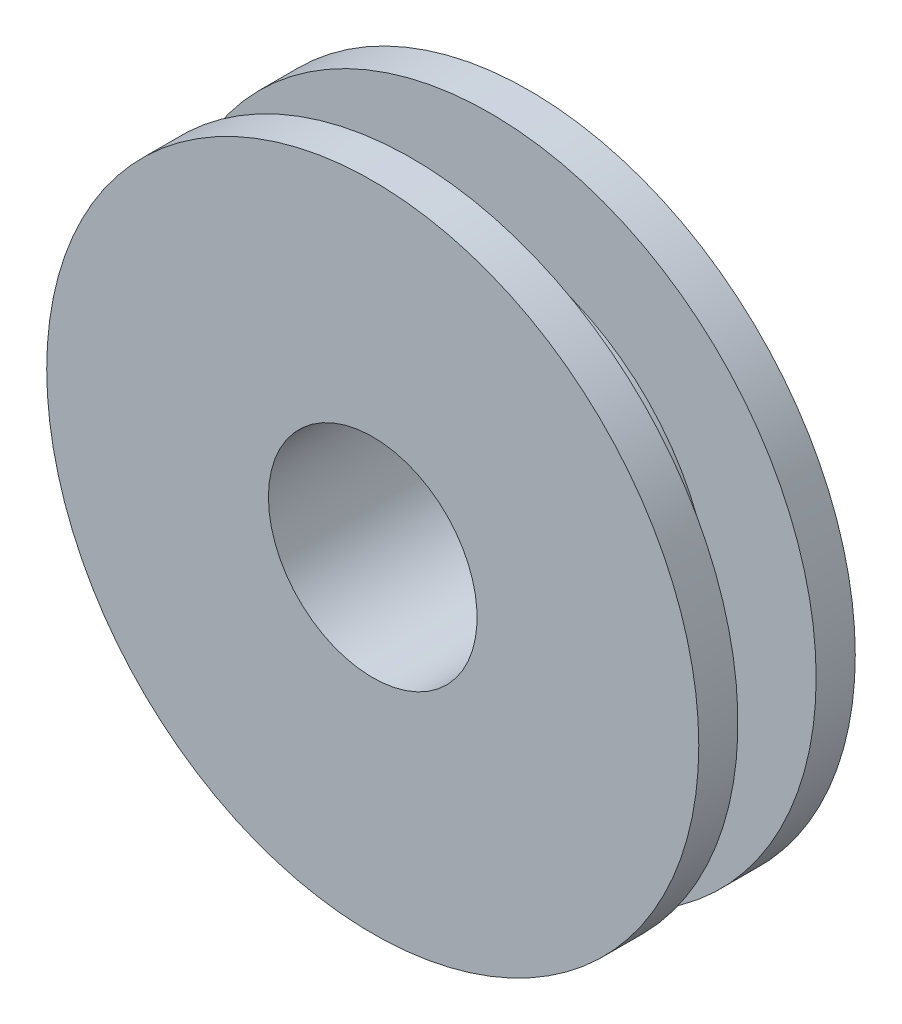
ISO-10303-21;
HEADER;
FILE_DESCRIPTION(('STEP AP214'),'2;1');
FILE_NAME('part.step','',(''),(''),'','','');
FILE_SCHEMA(('AUTOMOTIVE_DESIGN { 1 0 10303 214 1 1 1 1 }'));
ENDSEC;
DATA;
#1=APPLICATION_CONTEXT('core data for automotive mechanical design processes');
#2=APPLICATION_PROTOCOL_DEFINITION('international standard','automotive_design',2000,#1);
#3=PRODUCT_CONTEXT('',#1,'mechanical');
#4=PRODUCT('Part','Part','',(#3));
#5=PRODUCT_RELATED_PRODUCT_CATEGORY('part','',(#4));
#6=PRODUCT_DEFINITION_FORMATION('','',#4);
#7=PRODUCT_DEFINITION_CONTEXT('part definition',#1,'design');
#8=PRODUCT_DEFINITION('design','',#6,#7);
#9=PRODUCT_DEFINITION_SHAPE('','',#8);
#10=(LENGTH_UNIT() NAMED_UNIT(*) SI_UNIT(.MILLI.,.METRE.));
#11=(NAMED_UNIT(*) PLANE_ANGLE_UNIT() SI_UNIT($,.RADIAN.));
#12=(NAMED_UNIT(*) SI_UNIT($,.STERADIAN.) SOLID_ANGLE_UNIT());
#13=UNCERTAINTY_MEASURE_WITH_UNIT(LENGTH_MEASURE(1.E-05),#10,'distance_accuracy_value','');
#14=(GEOMETRIC_REPRESENTATION_CONTEXT(3) GLOBAL_UNCERTAINTY_ASSIGNED_CONTEXT((#13)) GLOBAL_UNIT_ASSIGNED_CONTEXT((#10,
#11,#12)) REPRESENTATION_CONTEXT('',''));
#15=CARTESIAN_POINT('',(0.,0.,0.));
#16=DIRECTION('',(0.,0.,1.));
#17=DIRECTION('',(1.,0.,0.));
#18=AXIS2_PLACEMENT_3D('',#15,#16,#17);
#19=CARTESIAN_POINT('',(0.,0.,6.));
#20=DIRECTION('',(0.,0.,-1.));
#21=DIRECTION('',(-1.,0.,0.));
#22=AXIS2_PLACEMENT_3D('',#19,#20,#21);
#23=CYLINDRICAL_SURFACE('',#22,12.5);
#24=CARTESIAN_POINT('',(0.,0.,0.));
#25=DIRECTION('',(0.,0.,1.));
#26=DIRECTION('',(1.,0.,0.));
#27=AXIS2_PLACEMENT_3D('',#24,#25,#26);
#28=CIRCLE('',#27,12.5);
#29=CARTESIAN_POINT('',(12.5,0.,0.));
#30=VERTEX_POINT('',#29);
#31=EDGE_CURVE('E40',#30,#30,#28,.T.);
#32=ORIENTED_EDGE('',*,*,#31,.T.);
#33=EDGE_LOOP('',(#32));
#34=FACE_BOUND('',#33,.T.);
#35=CARTESIAN_POINT('',(0.,0.,1.5));
#36=DIRECTION('',(0.,0.,1.));
#37=DIRECTION('',(1.,0.,0.));
#38=AXIS2_PLACEMENT_3D('',#35,#36,#37);
#39=CIRCLE('',#38,12.5);
#40=CARTESIAN_POINT('',(12.5,0.,1.5));
#41=VERTEX_POINT('',#40);
#42=EDGE_CURVE('E36',#41,#41,#39,.T.);
#43=ORIENTED_EDGE('',*,*,#42,.F.);
#44=EDGE_LOOP('',(#43));
#45=FACE_BOUND('',#44,.T.);
#46=ADVANCED_FACE('F33',(#34,#45),#23,.T.);
#47=CARTESIAN_POINT('',(0.,0.,0.));
#48=DIRECTION('',(0.,0.,1.));
#49=DIRECTION('',(1.,0.,0.));
#50=AXIS2_PLACEMENT_3D('',#47,#48,#49);
#51=PLANE('',#50);
#52=CARTESIAN_POINT('',(0.,0.,0.));
#53=DIRECTION('',(0.,0.,1.));
#54=DIRECTION('',(1.,0.,0.));
#55=AXIS2_PLACEMENT_3D('',#52,#53,#54);
#56=CIRCLE('',#55,6.5);
#57=CARTESIAN_POINT('',(6.5,0.,0.));
#58=VERTEX_POINT('',#57);
#59=EDGE_CURVE('E63',#58,#58,#56,.T.);
#60=ORIENTED_EDGE('',*,*,#59,.T.);
#61=EDGE_LOOP('',(#60));
#62=FACE_BOUND('',#61,.T.);
#63=ORIENTED_EDGE('',*,*,#31,.F.);
#64=EDGE_LOOP('',(#63));
#65=FACE_BOUND('',#64,.T.);
#66=ADVANCED_FACE('F88',(#62,#65),#51,.F.);
#67=CARTESIAN_POINT('',(13.5,0.,1.49999999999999));
#68=DIRECTION('',(0.,0.,1.));
#69=DIRECTION('',(1.,0.,0.));
#70=AXIS2_PLACEMENT_3D('',#67,#68,#69);
#71=PLANE('',#70);
#72=CARTESIAN_POINT('',(0.,0.,1.5));
#73=DIRECTION('',(0.,0.,-1.));
#74=DIRECTION('',(-1.,0.,0.));
#75=AXIS2_PLACEMENT_3D('',#72,#73,#74);
#76=CIRCLE('',#75,8.5);
#77=CARTESIAN_POINT('',(-8.5,0.,1.5));
#78=VERTEX_POINT('',#77);
#79=EDGE_CURVE('E49',#78,#78,#76,.T.);
#80=ORIENTED_EDGE('',*,*,#79,.T.);
#81=EDGE_LOOP('',(#80));
#82=FACE_BOUND('',#81,.T.);
#83=ORIENTED_EDGE('',*,*,#42,.T.);
#84=EDGE_LOOP('',(#83));
#85=FACE_BOUND('',#84,.T.);
#86=ADVANCED_FACE('F91',(#82,#85),#71,.T.);
#87=CARTESIAN_POINT('',(8.5,0.,4.5));
#88=DIRECTION('',(0.,0.,-1.));
#89=DIRECTION('',(-1.,0.,0.));
#90=AXIS2_PLACEMENT_3D('',#87,#88,#89);
#91=PLANE('',#90);
#92=CARTESIAN_POINT('',(0.,0.,4.5));
#93=DIRECTION('',(0.,0.,-1.));
#94=DIRECTION('',(-1.,0.,0.));
#95=AXIS2_PLACEMENT_3D('',#92,#93,#94);
#96=CIRCLE('',#95,8.5);
#97=CARTESIAN_POINT('',(-8.49999999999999,0.,4.5));
#98=VERTEX_POINT('',#97);
#99=EDGE_CURVE('E54',#98,#98,#96,.T.);
#100=ORIENTED_EDGE('',*,*,#99,.F.);
#101=EDGE_LOOP('',(#100));
#102=FACE_BOUND('',#101,.T.);
#103=CARTESIAN_POINT('',(0.,0.,4.5));
#104=DIRECTION('',(0.,0.,-1.));
#105=DIRECTION('',(-1.,0.,0.));
#106=AXIS2_PLACEMENT_3D('',#103,#104,#105);
#107=CIRCLE('',#106,12.5);
#108=CARTESIAN_POINT('',(-12.5,0.,4.5));
#109=VERTEX_POINT('',#108);
#110=EDGE_CURVE('E47',#109,#109,#107,.T.);
#111=ORIENTED_EDGE('',*,*,#110,.T.);
#112=EDGE_LOOP('',(#111));
#113=FACE_BOUND('',#112,.T.);
#114=ADVANCED_FACE('F100',(#102,#113),#91,.T.);
#115=CARTESIAN_POINT('',(0.,0.,0.));
#116=DIRECTION('',(0.,0.,-1.));
#117=DIRECTION('',(-1.,0.,0.));
#118=AXIS2_PLACEMENT_3D('',#115,#116,#117);
#119=CYLINDRICAL_SURFACE('',#118,8.5);
#120=ORIENTED_EDGE('',*,*,#79,.F.);
#121=EDGE_LOOP('',(#120));
#122=FACE_BOUND('',#121,.T.);
#123=ORIENTED_EDGE('',*,*,#99,.T.);
#124=EDGE_LOOP('',(#123));
#125=FACE_BOUND('',#124,.T.);
#126=ADVANCED_FACE('F105',(#122,#125),#119,.T.);
#127=CARTESIAN_POINT('',(0.,0.,6.));
#128=DIRECTION('',(0.,0.,1.));
#129=DIRECTION('',(1.,0.,0.));
#130=AXIS2_PLACEMENT_3D('',#127,#128,#129);
#131=PLANE('',#130);
#132=CARTESIAN_POINT('',(0.,0.,6.));
#133=DIRECTION('',(0.,0.,-1.));
#134=DIRECTION('',(-1.,0.,0.));
#135=AXIS2_PLACEMENT_3D('',#132,#133,#134);
#136=CIRCLE('',#135,4.);
#137=CARTESIAN_POINT('',(-4.,0.,6.));
#138=VERTEX_POINT('',#137);
#139=EDGE_CURVE('E66',#138,#138,#136,.T.);
#140=ORIENTED_EDGE('',*,*,#139,.T.);
#141=EDGE_LOOP('',(#140));
#142=FACE_BOUND('',#141,.T.);
#143=CARTESIAN_POINT('',(0.,0.,6.));
#144=DIRECTION('',(0.,0.,1.));
#145=DIRECTION('',(1.,0.,0.));
#146=AXIS2_PLACEMENT_3D('',#143,#144,#145);
#147=CIRCLE('',#146,12.5);
#148=CARTESIAN_POINT('',(12.5,0.,5.99999999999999));
#149=VERTEX_POINT('',#148);
#150=EDGE_CURVE('E10',#149,#149,#147,.T.);
#151=ORIENTED_EDGE('',*,*,#150,.T.);
#152=EDGE_LOOP('',(#151));
#153=FACE_BOUND('',#152,.T.);
#154=ADVANCED_FACE('F110',(#142,#153),#131,.T.);
#155=ORIENTED_EDGE('',*,*,#150,.F.);
#156=EDGE_LOOP('',(#155));
#157=FACE_BOUND('',#156,.T.);
#158=ORIENTED_EDGE('',*,*,#110,.F.);
#159=EDGE_LOOP('',(#158));
#160=FACE_BOUND('',#159,.T.);
#161=ADVANCED_FACE('F84',(#157,#160),#23,.T.);
#162=CARTESIAN_POINT('',(0.,0.,0.));
#163=DIRECTION('',(0.,0.,1.));
#164=DIRECTION('',(1.,0.,0.));
#165=AXIS2_PLACEMENT_3D('',#162,#163,#164);
#166=CONICAL_SURFACE('',#165,6.5,0.78539816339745);
#167=CARTESIAN_POINT('',(0.,0.,-0.5));
#168=DIRECTION('',(0.,0.,1.));
#169=DIRECTION('',(1.,0.,0.));
#170=AXIS2_PLACEMENT_3D('',#167,#168,#169);
#171=CIRCLE('',#170,6.);
#172=CARTESIAN_POINT('',(6.,0.,-0.500000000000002));
#173=VERTEX_POINT('',#172);
#174=EDGE_CURVE('E58',#173,#173,#171,.T.);
#175=ORIENTED_EDGE('',*,*,#174,.T.);
#176=EDGE_LOOP('',(#175));
#177=FACE_BOUND('',#176,.T.);
#178=ORIENTED_EDGE('',*,*,#59,.F.);
#179=EDGE_LOOP('',(#178));
#180=FACE_BOUND('',#179,.T.);
#181=ADVANCED_FACE('F78',(#177,#180),#166,.T.);
#182=CARTESIAN_POINT('',(0.,0.,-0.5));
#183=DIRECTION('',(0.,0.,1.));
#184=DIRECTION('',(1.,0.,0.));
#185=AXIS2_PLACEMENT_3D('',#182,#183,#184);
#186=PLANE('',#185);
#187=CARTESIAN_POINT('',(0.,0.,-0.5));
#188=DIRECTION('',(0.,0.,-1.));
#189=DIRECTION('',(-1.,0.,0.));
#190=AXIS2_PLACEMENT_3D('',#187,#188,#189);
#191=CIRCLE('',#190,4.);
#192=CARTESIAN_POINT('',(-4.,0.,-0.499999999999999));
#193=VERTEX_POINT('',#192);
#194=EDGE_CURVE('E69',#193,#193,#191,.T.);
#195=ORIENTED_EDGE('',*,*,#194,.F.);
#196=EDGE_LOOP('',(#195));
#197=FACE_BOUND('',#196,.T.);
#198=ORIENTED_EDGE('',*,*,#174,.F.);
#199=EDGE_LOOP('',(#198));
#200=FACE_BOUND('',#199,.T.);
#201=ADVANCED_FACE('F75',(#197,#200),#186,.F.);
#202=CARTESIAN_POINT('',(0.,0.,6.));
#203=DIRECTION('',(0.,0.,-1.));
#204=DIRECTION('',(-1.,0.,0.));
#205=AXIS2_PLACEMENT_3D('',#202,#203,#204);
#206=CYLINDRICAL_SURFACE('',#205,4.);
#207=ORIENTED_EDGE('',*,*,#139,.F.);
#208=EDGE_LOOP('',(#207));
#209=FACE_BOUND('',#208,.T.);
#210=ORIENTED_EDGE('',*,*,#194,.T.);
#211=EDGE_LOOP('',(#210));
#212=FACE_BOUND('',#211,.T.);
#213=ADVANCED_FACE('F73',(#209,#212),#206,.F.);
#214=CLOSED_SHELL('',(#46,#66,#86,#114,#126,#154,#161,#181,#201,#213));
#215=MANIFOLD_SOLID_BREP('B2',#214);
#216=ADVANCED_BREP_SHAPE_REPRESENTATION('',(#18,#215),#14);
#217=SHAPE_DEFINITION_REPRESENTATION(#9,#216);
ENDSEC;
END-ISO-10303-21;
